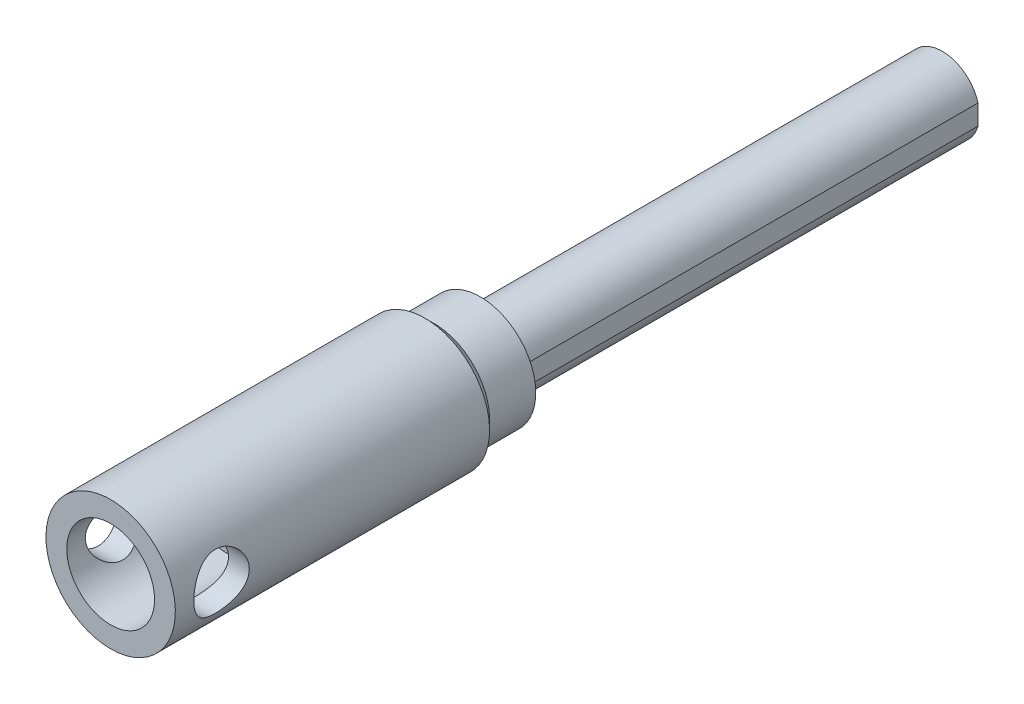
ISO-10303-21;
HEADER;
FILE_DESCRIPTION(('STEP AP214'),'2;1');
FILE_NAME('part.step','',(''),(''),'','','');
FILE_SCHEMA(('AUTOMOTIVE_DESIGN { 1 0 10303 214 1 1 1 1 }'));
ENDSEC;
DATA;
#1=APPLICATION_CONTEXT('core data for automotive mechanical design processes');
#2=APPLICATION_PROTOCOL_DEFINITION('international standard','automotive_design',2000,#1);
#3=PRODUCT_CONTEXT('',#1,'mechanical');
#4=PRODUCT('Part','Part','',(#3));
#5=PRODUCT_RELATED_PRODUCT_CATEGORY('part','',(#4));
#6=PRODUCT_DEFINITION_FORMATION('','',#4);
#7=PRODUCT_DEFINITION_CONTEXT('part definition',#1,'design');
#8=PRODUCT_DEFINITION('design','',#6,#7);
#9=PRODUCT_DEFINITION_SHAPE('','',#8);
#10=(LENGTH_UNIT() NAMED_UNIT(*) SI_UNIT(.MILLI.,.METRE.));
#11=(NAMED_UNIT(*) PLANE_ANGLE_UNIT() SI_UNIT($,.RADIAN.));
#12=(NAMED_UNIT(*) SI_UNIT($,.STERADIAN.) SOLID_ANGLE_UNIT());
#13=UNCERTAINTY_MEASURE_WITH_UNIT(LENGTH_MEASURE(1.E-05),#10,'distance_accuracy_value','');
#14=(GEOMETRIC_REPRESENTATION_CONTEXT(3) GLOBAL_UNCERTAINTY_ASSIGNED_CONTEXT((#13)) GLOBAL_UNIT_ASSIGNED_CONTEXT((#10,
#11,#12)) REPRESENTATION_CONTEXT('',''));
#15=CARTESIAN_POINT('',(0.,0.,0.));
#16=DIRECTION('',(0.,0.,1.));
#17=DIRECTION('',(1.,0.,0.));
#18=AXIS2_PLACEMENT_3D('',#15,#16,#17);
#19=CARTESIAN_POINT('',(2.3094010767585,0.,75.));
#20=DIRECTION('',(-0.866025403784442,0.5,0.));
#21=DIRECTION('',(-0.5,-0.866025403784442,0.));
#22=AXIS2_PLACEMENT_3D('',#19,#20,#21);
#23=PLANE('',#22);
#24=DIRECTION('',(0.,0.,1.));
#25=VECTOR('',#24,1.);
#26=CARTESIAN_POINT('',(1.15470053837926,-2.,75.));
#27=LINE('',#26,#25);
#28=CARTESIAN_POINT('',(1.15470053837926,-2.,75.));
#29=VERTEX_POINT('',#28);
#30=CARTESIAN_POINT('',(1.15470053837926,-2.,77.5));
#31=VERTEX_POINT('',#30);
#32=EDGE_CURVE('E273',#29,#31,#27,.T.);
#33=ORIENTED_EDGE('',*,*,#32,.T.);
#34=DIRECTION('',(-0.5,-0.866025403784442,0.));
#35=VECTOR('',#34,1.);
#36=CARTESIAN_POINT('',(2.3094010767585,0.,77.5));
#37=LINE('',#36,#35);
#38=CARTESIAN_POINT('',(2.3094010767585,0.,77.5));
#39=VERTEX_POINT('',#38);
#40=EDGE_CURVE('E29',#39,#31,#37,.T.);
#41=ORIENTED_EDGE('',*,*,#40,.F.);
#42=DIRECTION('',(0.,0.,1.));
#43=VECTOR('',#42,1.);
#44=CARTESIAN_POINT('',(2.3094010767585,0.,75.));
#45=LINE('',#44,#43);
#46=CARTESIAN_POINT('',(2.3094010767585,0.,75.));
#47=VERTEX_POINT('',#46);
#48=EDGE_CURVE('E33',#47,#39,#45,.T.);
#49=ORIENTED_EDGE('',*,*,#48,.F.);
#50=DIRECTION('',(-0.5,-0.866025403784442,0.));
#51=VECTOR('',#50,1.);
#52=CARTESIAN_POINT('',(2.3094010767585,0.,75.));
#53=LINE('',#52,#51);
#54=EDGE_CURVE('E234',#47,#29,#53,.T.);
#55=ORIENTED_EDGE('',*,*,#54,.T.);
#56=EDGE_LOOP('',(#33,#41,#49,#55));
#57=FACE_BOUND('',#56,.T.);
#58=ADVANCED_FACE('F14',(#57),#23,.T.);
#59=CARTESIAN_POINT('',(-1.15470053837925,-2.,75.));
#60=DIRECTION('',(0.,-1.,0.));
#61=DIRECTION('',(0.,0.,-1.));
#62=AXIS2_PLACEMENT_3D('',#59,#60,#61);
#63=PLANE('',#62);
#64=DIRECTION('',(0.,0.,1.));
#65=VECTOR('',#64,1.);
#66=CARTESIAN_POINT('',(-1.15470053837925,-2.,75.));
#67=LINE('',#66,#65);
#68=CARTESIAN_POINT('',(-1.15470053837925,-2.,75.));
#69=VERTEX_POINT('',#68);
#70=CARTESIAN_POINT('',(-1.15470053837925,-2.,77.5));
#71=VERTEX_POINT('',#70);
#72=EDGE_CURVE('E271',#69,#71,#67,.T.);
#73=ORIENTED_EDGE('',*,*,#72,.T.);
#74=DIRECTION('',(1.,0.,0.));
#75=VECTOR('',#74,1.);
#76=CARTESIAN_POINT('',(-1.15470053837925,-2.,77.5));
#77=LINE('',#76,#75);
#78=EDGE_CURVE('E244',#71,#31,#77,.T.);
#79=ORIENTED_EDGE('',*,*,#78,.T.);
#80=ORIENTED_EDGE('',*,*,#32,.F.);
#81=DIRECTION('',(1.,0.,0.));
#82=VECTOR('',#81,1.);
#83=CARTESIAN_POINT('',(-1.15470053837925,-2.,75.));
#84=LINE('',#83,#82);
#85=EDGE_CURVE('E260',#69,#29,#84,.T.);
#86=ORIENTED_EDGE('',*,*,#85,.F.);
#87=EDGE_LOOP('',(#73,#79,#80,#86));
#88=FACE_BOUND('',#87,.T.);
#89=ADVANCED_FACE('F164',(#88),#63,.F.);
#90=CARTESIAN_POINT('',(-2.3094010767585,0.,75.));
#91=DIRECTION('',(-0.866025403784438,-0.5,0.));
#92=DIRECTION('',(0.5,-0.866025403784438,0.));
#93=AXIS2_PLACEMENT_3D('',#90,#91,#92);
#94=PLANE('',#93);
#95=DIRECTION('',(0.,0.,1.));
#96=VECTOR('',#95,1.);
#97=CARTESIAN_POINT('',(-2.3094010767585,0.,75.));
#98=LINE('',#97,#96);
#99=CARTESIAN_POINT('',(-2.3094010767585,0.,75.));
#100=VERTEX_POINT('',#99);
#101=CARTESIAN_POINT('',(-2.3094010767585,0.,77.5));
#102=VERTEX_POINT('',#101);
#103=EDGE_CURVE('E269',#100,#102,#98,.T.);
#104=ORIENTED_EDGE('',*,*,#103,.T.);
#105=DIRECTION('',(0.5,-0.866025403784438,0.));
#106=VECTOR('',#105,1.);
#107=CARTESIAN_POINT('',(-2.3094010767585,0.,77.5));
#108=LINE('',#107,#106);
#109=EDGE_CURVE('E241',#102,#71,#108,.T.);
#110=ORIENTED_EDGE('',*,*,#109,.T.);
#111=ORIENTED_EDGE('',*,*,#72,.F.);
#112=DIRECTION('',(0.5,-0.866025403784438,0.));
#113=VECTOR('',#112,1.);
#114=CARTESIAN_POINT('',(-2.3094010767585,0.,75.));
#115=LINE('',#114,#113);
#116=EDGE_CURVE('E257',#100,#69,#115,.T.);
#117=ORIENTED_EDGE('',*,*,#116,.F.);
#118=EDGE_LOOP('',(#104,#110,#111,#117));
#119=FACE_BOUND('',#118,.T.);
#120=ADVANCED_FACE('F169',(#119),#94,.F.);
#121=CARTESIAN_POINT('',(-2.3094010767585,0.,75.));
#122=DIRECTION('',(0.866025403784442,-0.5,0.));
#123=DIRECTION('',(0.5,0.866025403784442,0.));
#124=AXIS2_PLACEMENT_3D('',#121,#122,#123);
#125=PLANE('',#124);
#126=DIRECTION('',(0.,0.,1.));
#127=VECTOR('',#126,1.);
#128=CARTESIAN_POINT('',(-1.15470053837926,2.,75.));
#129=LINE('',#128,#127);
#130=CARTESIAN_POINT('',(-1.15470053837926,2.,75.));
#131=VERTEX_POINT('',#130);
#132=CARTESIAN_POINT('',(-1.15470053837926,2.,77.5));
#133=VERTEX_POINT('',#132);
#134=EDGE_CURVE('E267',#131,#133,#129,.T.);
#135=ORIENTED_EDGE('',*,*,#134,.T.);
#136=DIRECTION('',(0.5,0.866025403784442,0.));
#137=VECTOR('',#136,1.);
#138=CARTESIAN_POINT('',(-2.3094010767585,0.,77.5));
#139=LINE('',#138,#137);
#140=EDGE_CURVE('E238',#102,#133,#139,.T.);
#141=ORIENTED_EDGE('',*,*,#140,.F.);
#142=ORIENTED_EDGE('',*,*,#103,.F.);
#143=DIRECTION('',(0.5,0.866025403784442,0.));
#144=VECTOR('',#143,1.);
#145=CARTESIAN_POINT('',(-2.3094010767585,0.,75.));
#146=LINE('',#145,#144);
#147=EDGE_CURVE('E254',#100,#131,#146,.T.);
#148=ORIENTED_EDGE('',*,*,#147,.T.);
#149=EDGE_LOOP('',(#135,#141,#142,#148));
#150=FACE_BOUND('',#149,.T.);
#151=ADVANCED_FACE('F183',(#150),#125,.T.);
#152=CARTESIAN_POINT('',(1.15470053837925,2.,75.));
#153=DIRECTION('',(0.,1.,0.));
#154=DIRECTION('',(-1.,0.,0.));
#155=AXIS2_PLACEMENT_3D('',#152,#153,#154);
#156=PLANE('',#155);
#157=DIRECTION('',(0.,0.,1.));
#158=VECTOR('',#157,1.);
#159=CARTESIAN_POINT('',(1.15470053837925,2.,75.));
#160=LINE('',#159,#158);
#161=CARTESIAN_POINT('',(1.15470053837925,2.,75.));
#162=VERTEX_POINT('',#161);
#163=CARTESIAN_POINT('',(1.15470053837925,2.,77.5));
#164=VERTEX_POINT('',#163);
#165=EDGE_CURVE('E265',#162,#164,#160,.T.);
#166=ORIENTED_EDGE('',*,*,#165,.T.);
#167=DIRECTION('',(-1.,0.,0.));
#168=VECTOR('',#167,1.);
#169=CARTESIAN_POINT('',(1.15470053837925,2.,77.5));
#170=LINE('',#169,#168);
#171=EDGE_CURVE('E235',#164,#133,#170,.T.);
#172=ORIENTED_EDGE('',*,*,#171,.T.);
#173=ORIENTED_EDGE('',*,*,#134,.F.);
#174=DIRECTION('',(-1.,0.,0.));
#175=VECTOR('',#174,1.);
#176=CARTESIAN_POINT('',(1.15470053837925,2.,75.));
#177=LINE('',#176,#175);
#178=EDGE_CURVE('E251',#162,#131,#177,.T.);
#179=ORIENTED_EDGE('',*,*,#178,.F.);
#180=EDGE_LOOP('',(#166,#172,#173,#179));
#181=FACE_BOUND('',#180,.T.);
#182=ADVANCED_FACE('F179',(#181),#156,.F.);
#183=CARTESIAN_POINT('',(2.3094010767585,0.,75.));
#184=DIRECTION('',(0.866025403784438,0.5,0.));
#185=DIRECTION('',(-0.5,0.866025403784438,0.));
#186=AXIS2_PLACEMENT_3D('',#183,#184,#185);
#187=PLANE('',#186);
#188=DIRECTION('',(-0.5,0.866025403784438,0.));
#189=VECTOR('',#188,1.);
#190=CARTESIAN_POINT('',(2.3094010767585,0.,75.));
#191=LINE('',#190,#189);
#192=EDGE_CURVE('E248',#47,#162,#191,.T.);
#193=ORIENTED_EDGE('',*,*,#192,.F.);
#194=ORIENTED_EDGE('',*,*,#48,.T.);
#195=DIRECTION('',(-0.5,0.866025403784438,0.));
#196=VECTOR('',#195,1.);
#197=CARTESIAN_POINT('',(2.3094010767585,0.,77.5));
#198=LINE('',#197,#196);
#199=EDGE_CURVE('E231',#39,#164,#198,.T.);
#200=ORIENTED_EDGE('',*,*,#199,.T.);
#201=ORIENTED_EDGE('',*,*,#165,.F.);
#202=EDGE_LOOP('',(#193,#194,#200,#201));
#203=FACE_BOUND('',#202,.T.);
#204=ADVANCED_FACE('F176',(#203),#187,.F.);
#205=CARTESIAN_POINT('',(3.46410161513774,2.,75.));
#206=DIRECTION('',(0.,0.,-1.));
#207=DIRECTION('',(0.,1.,0.));
#208=AXIS2_PLACEMENT_3D('',#205,#206,#207);
#209=PLANE('',#208);
#210=ORIENTED_EDGE('',*,*,#54,.F.);
#211=ORIENTED_EDGE('',*,*,#192,.T.);
#212=ORIENTED_EDGE('',*,*,#178,.T.);
#213=ORIENTED_EDGE('',*,*,#147,.F.);
#214=ORIENTED_EDGE('',*,*,#116,.T.);
#215=ORIENTED_EDGE('',*,*,#85,.T.);
#216=EDGE_LOOP('',(#210,#211,#212,#213,#214,#215));
#217=FACE_BOUND('',#216,.T.);
#218=ADVANCED_FACE('F174',(#217),#209,.F.);
#219=CARTESIAN_POINT('',(0.,0.,77.5));
#220=DIRECTION('',(0.,0.,1.));
#221=DIRECTION('',(0.,-1.,0.));
#222=AXIS2_PLACEMENT_3D('',#219,#220,#221);
#223=PLANE('',#222);
#224=CARTESIAN_POINT('',(0.,0.,77.5));
#225=DIRECTION('',(0.,0.,1.));
#226=DIRECTION('',(0.,-1.,0.));
#227=AXIS2_PLACEMENT_3D('',#224,#225,#226);
#228=CIRCLE('',#227,4.25);
#229=CARTESIAN_POINT('',(0.,-4.25,77.5));
#230=VERTEX_POINT('',#229);
#231=EDGE_CURVE('E9',#230,#230,#228,.T.);
#232=ORIENTED_EDGE('',*,*,#231,.T.);
#233=EDGE_LOOP('',(#232));
#234=FACE_BOUND('',#233,.T.);
#235=ORIENTED_EDGE('',*,*,#199,.F.);
#236=ORIENTED_EDGE('',*,*,#40,.T.);
#237=ORIENTED_EDGE('',*,*,#78,.F.);
#238=ORIENTED_EDGE('',*,*,#109,.F.);
#239=ORIENTED_EDGE('',*,*,#140,.T.);
#240=ORIENTED_EDGE('',*,*,#171,.F.);
#241=EDGE_LOOP('',(#235,#236,#237,#238,#239,#240));
#242=FACE_BOUND('',#241,.T.);
#243=ADVANCED_FACE('F16',(#234,#242),#223,.T.);
#244=CARTESIAN_POINT('',(0.,0.,72.5));
#245=DIRECTION('',(0.,0.,1.));
#246=DIRECTION('',(0.,-1.,0.));
#247=AXIS2_PLACEMENT_3D('',#244,#245,#246);
#248=CYLINDRICAL_SURFACE('',#247,4.25);
#249=CARTESIAN_POINT('',(0.,0.,72.5));
#250=DIRECTION('',(0.,0.,1.));
#251=DIRECTION('',(0.,-1.,0.));
#252=AXIS2_PLACEMENT_3D('',#249,#250,#251);
#253=CIRCLE('',#252,4.25);
#254=CARTESIAN_POINT('',(0.,-4.25,72.5));
#255=VERTEX_POINT('',#254);
#256=EDGE_CURVE('E22',#255,#255,#253,.T.);
#257=ORIENTED_EDGE('',*,*,#256,.T.);
#258=EDGE_LOOP('',(#257));
#259=FACE_BOUND('',#258,.T.);
#260=ORIENTED_EDGE('',*,*,#231,.F.);
#261=EDGE_LOOP('',(#260));
#262=FACE_BOUND('',#261,.T.);
#263=ADVANCED_FACE('F190',(#259,#262),#248,.T.);
#264=CARTESIAN_POINT('',(0.,0.,0.));
#265=DIRECTION('',(0.,0.,1.));
#266=DIRECTION('',(-1.,0.,0.));
#267=AXIS2_PLACEMENT_3D('',#264,#265,#266);
#268=PLANE('',#267);
#269=DIRECTION('',(0.,-1.,0.));
#270=VECTOR('',#269,1.);
#271=CARTESIAN_POINT('',(3.85,-1.08512672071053,0.));
#272=LINE('',#271,#270);
#273=CARTESIAN_POINT('',(3.85,1.08512672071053,0.));
#274=VERTEX_POINT('',#273);
#275=CARTESIAN_POINT('',(3.85,-1.08512672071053,0.));
#276=VERTEX_POINT('',#275);
#277=EDGE_CURVE('E91',#274,#276,#272,.T.);
#278=ORIENTED_EDGE('',*,*,#277,.T.);
#279=CARTESIAN_POINT('',(0.,0.,0.));
#280=DIRECTION('',(0.,0.,1.));
#281=DIRECTION('',(-1.,0.,0.));
#282=AXIS2_PLACEMENT_3D('',#279,#280,#281);
#283=CIRCLE('',#282,4.);
#284=EDGE_CURVE('E83',#274,#276,#283,.T.);
#285=ORIENTED_EDGE('',*,*,#284,.F.);
#286=EDGE_LOOP('',(#278,#285));
#287=FACE_BOUND('',#286,.T.);
#288=ADVANCED_FACE('F95',(#287),#268,.F.);
#289=CARTESIAN_POINT('',(3.85,-1.08512672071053,60.));
#290=DIRECTION('',(1.,0.,0.));
#291=DIRECTION('',(0.,0.,1.));
#292=AXIS2_PLACEMENT_3D('',#289,#290,#291);
#293=PLANE('',#292);
#294=DIRECTION('',(0.,1.,0.));
#295=VECTOR('',#294,1.);
#296=CARTESIAN_POINT('',(3.85,5.9999999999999,50.));
#297=LINE('',#296,#295);
#298=CARTESIAN_POINT('',(3.85,-1.08512672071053,50.));
#299=VERTEX_POINT('',#298);
#300=CARTESIAN_POINT('',(3.85,1.08512672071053,50.));
#301=VERTEX_POINT('',#300);
#302=EDGE_CURVE('E226',#299,#301,#297,.T.);
#303=ORIENTED_EDGE('',*,*,#302,.F.);
#304=DIRECTION('',(0.,0.,-1.));
#305=VECTOR('',#304,1.);
#306=CARTESIAN_POINT('',(3.85,-1.08512672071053,60.));
#307=LINE('',#306,#305);
#308=EDGE_CURVE('E88',#299,#276,#307,.T.);
#309=ORIENTED_EDGE('',*,*,#308,.T.);
#310=ORIENTED_EDGE('',*,*,#277,.F.);
#311=DIRECTION('',(0.,0.,-1.));
#312=VECTOR('',#311,1.);
#313=CARTESIAN_POINT('',(3.85,1.08512672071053,60.));
#314=LINE('',#313,#312);
#315=EDGE_CURVE('E78',#301,#274,#314,.T.);
#316=ORIENTED_EDGE('',*,*,#315,.F.);
#317=EDGE_LOOP('',(#303,#309,#310,#316));
#318=FACE_BOUND('',#317,.T.);
#319=ADVANCED_FACE('F92',(#318),#293,.T.);
#320=CARTESIAN_POINT('',(0.,0.,60.));
#321=DIRECTION('',(0.,0.,-1.));
#322=DIRECTION('',(1.,0.,0.));
#323=AXIS2_PLACEMENT_3D('',#320,#321,#322);
#324=CYLINDRICAL_SURFACE('',#323,4.);
#325=ORIENTED_EDGE('',*,*,#308,.F.);
#326=CARTESIAN_POINT('',(0.,0.,50.));
#327=DIRECTION('',(0.,0.,1.));
#328=DIRECTION('',(-6.15310496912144E-10,1.,0.));
#329=AXIS2_PLACEMENT_3D('',#326,#327,#328);
#330=CIRCLE('',#329,4.);
#331=EDGE_CURVE('E84',#299,#301,#330,.F.);
#332=ORIENTED_EDGE('',*,*,#331,.T.);
#333=ORIENTED_EDGE('',*,*,#315,.T.);
#334=ORIENTED_EDGE('',*,*,#284,.T.);
#335=EDGE_LOOP('',(#325,#332,#333,#334));
#336=FACE_BOUND('',#335,.T.);
#337=ADVANCED_FACE('F81',(#336),#324,.T.);
#338=CARTESIAN_POINT('',(0.,5.99999999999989,50.));
#339=DIRECTION('',(0.,0.,1.));
#340=DIRECTION('',(0.,-1.,0.));
#341=AXIS2_PLACEMENT_3D('',#338,#339,#340);
#342=PLANE('',#341);
#343=CARTESIAN_POINT('',(0.,0.,50.));
#344=DIRECTION('',(0.,0.,1.));
#345=DIRECTION('',(0.,-1.,0.));
#346=AXIS2_PLACEMENT_3D('',#343,#344,#345);
#347=CIRCLE('',#346,5.99999999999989);
#348=CARTESIAN_POINT('',(0.,-5.99999999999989,50.));
#349=VERTEX_POINT('',#348);
#350=EDGE_CURVE('E221',#349,#349,#347,.T.);
#351=ORIENTED_EDGE('',*,*,#350,.F.);
#352=EDGE_LOOP('',(#351));
#353=FACE_BOUND('',#352,.T.);
#354=ORIENTED_EDGE('',*,*,#331,.F.);
#355=ORIENTED_EDGE('',*,*,#302,.T.);
#356=EDGE_LOOP('',(#354,#355));
#357=FACE_BOUND('',#356,.T.);
#358=ADVANCED_FACE('F327',(#353,#357),#342,.F.);
#359=CARTESIAN_POINT('',(0.,0.,92.7596866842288));
#360=DIRECTION('',(0.,0.,1.));
#361=DIRECTION('',(0.,-1.,0.));
#362=AXIS2_PLACEMENT_3D('',#359,#360,#361);
#363=CYLINDRICAL_SURFACE('',#362,5.99999999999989);
#364=CARTESIAN_POINT('',(0.,0.,55.));
#365=DIRECTION('',(0.,0.,1.));
#366=DIRECTION('',(0.,-1.,0.));
#367=AXIS2_PLACEMENT_3D('',#364,#365,#366);
#368=CIRCLE('',#367,5.99999999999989);
#369=CARTESIAN_POINT('',(0.,-5.99999999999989,55.));
#370=VERTEX_POINT('',#369);
#371=EDGE_CURVE('E219',#370,#370,#368,.T.);
#372=ORIENTED_EDGE('',*,*,#371,.F.);
#373=EDGE_LOOP('',(#372));
#374=FACE_BOUND('',#373,.T.);
#375=ORIENTED_EDGE('',*,*,#350,.T.);
#376=EDGE_LOOP('',(#375));
#377=FACE_BOUND('',#376,.T.);
#378=ADVANCED_FACE('F335',(#374,#377),#363,.T.);
#379=CARTESIAN_POINT('',(0.,0.,56.));
#380=DIRECTION('',(0.,0.,1.));
#381=DIRECTION('',(0.,-1.,0.));
#382=AXIS2_PLACEMENT_3D('',#379,#380,#381);
#383=CONICAL_SURFACE('',#382,7.0000000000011,0.78539816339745);
#384=ORIENTED_EDGE('',*,*,#371,.T.);
#385=EDGE_LOOP('',(#384));
#386=FACE_BOUND('',#385,.T.);
#387=CARTESIAN_POINT('',(0.,0.,56.));
#388=DIRECTION('',(0.,0.,1.));
#389=DIRECTION('',(0.,-1.,0.));
#390=AXIS2_PLACEMENT_3D('',#387,#388,#389);
#391=CIRCLE('',#390,7.0000000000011);
#392=CARTESIAN_POINT('',(0.,-7.0000000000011,56.));
#393=VERTEX_POINT('',#392);
#394=EDGE_CURVE('E145',#393,#393,#391,.T.);
#395=ORIENTED_EDGE('',*,*,#394,.F.);
#396=EDGE_LOOP('',(#395));
#397=FACE_BOUND('',#396,.T.);
#398=ADVANCED_FACE('F128',(#386,#397),#383,.T.);
#399=CARTESIAN_POINT('',(0.,0.,92.7596866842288));
#400=DIRECTION('',(0.,0.,1.));
#401=DIRECTION('',(0.,-1.,0.));
#402=AXIS2_PLACEMENT_3D('',#399,#400,#401);
#403=CYLINDRICAL_SURFACE('',#402,7.0000000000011);
#404=ORIENTED_EDGE('',*,*,#394,.T.);
#405=EDGE_LOOP('',(#404));
#406=FACE_BOUND('',#405,.T.);
#407=CARTESIAN_POINT('',(-7.0000000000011,1.09818090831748E-12,88.));
#408=CARTESIAN_POINT('',(-6.99999408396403,-0.160281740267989,87.9999925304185));
#409=CARTESIAN_POINT('',(-6.9944325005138,-0.320833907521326,87.9870786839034));
#410=CARTESIAN_POINT('',(-6.97273920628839,-0.637349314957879,87.9359176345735));
#411=CARTESIAN_POINT('',(-6.95658080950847,-0.793299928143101,87.8976064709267));
#412=CARTESIAN_POINT('',(-6.91541630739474,-1.09553470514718,87.7973302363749));
#413=CARTESIAN_POINT('',(-6.89044089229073,-1.24185033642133,87.7354471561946));
#414=CARTESIAN_POINT('',(-6.83405660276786,-1.52187332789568,87.5901355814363));
#415=CARTESIAN_POINT('',(-6.80264947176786,-1.65558409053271,87.5067129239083));
#416=CARTESIAN_POINT('',(-6.73467821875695,-1.91384144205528,87.3160723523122));
#417=CARTESIAN_POINT('',(-6.6979389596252,-2.03764045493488,87.2079047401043));
#418=CARTESIAN_POINT('',(-6.62417654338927,-2.26599040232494,86.9728561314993));
#419=CARTESIAN_POINT('',(-6.58715324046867,-2.37053065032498,86.8459648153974));
#420=CARTESIAN_POINT('',(-6.51482055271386,-2.56285686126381,86.5689672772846));
#421=CARTESIAN_POINT('',(-6.4797046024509,-2.64946811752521,86.4179895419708));
#422=CARTESIAN_POINT('',(-6.41796168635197,-2.79573199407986,86.1018905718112));
#423=CARTESIAN_POINT('',(-6.39133010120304,-2.85539929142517,85.9367770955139));
#424=CARTESIAN_POINT('',(-6.35147799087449,-2.94294919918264,85.6056992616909));
#425=CARTESIAN_POINT('',(-6.33765221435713,-2.97227494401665,85.4401922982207));
#426=CARTESIAN_POINT('',(-6.32324849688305,-3.00280607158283,85.1060740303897));
#427=CARTESIAN_POINT('',(-6.32266262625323,-3.00402828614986,84.9374646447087));
#428=CARTESIAN_POINT('',(-6.33429573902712,-2.97939999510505,84.6167000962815));
#429=CARTESIAN_POINT('',(-6.34546870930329,-2.95576113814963,84.464329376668));
#430=CARTESIAN_POINT('',(-6.37758411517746,-2.88580772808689,84.1659724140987));
#431=CARTESIAN_POINT('',(-6.39852855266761,-2.83948852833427,84.0199874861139));
#432=CARTESIAN_POINT('',(-6.44830685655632,-2.72457659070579,83.7347528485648));
#433=CARTESIAN_POINT('',(-6.47730295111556,-2.65551974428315,83.5957197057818));
#434=CARTESIAN_POINT('',(-6.5398849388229,-2.497423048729,83.3306536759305));
#435=CARTESIAN_POINT('',(-6.57347269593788,-2.40837507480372,83.2046261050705));
#436=CARTESIAN_POINT('',(-6.64512404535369,-2.20343405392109,82.9572224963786));
#437=CARTESIAN_POINT('',(-6.68331855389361,-2.08584728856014,82.837283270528));
#438=CARTESIAN_POINT('',(-6.75734605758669,-1.83187332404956,82.618328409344));
#439=CARTESIAN_POINT('',(-6.79317843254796,-1.69548121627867,82.5193182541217));
#440=CARTESIAN_POINT('',(-6.85959693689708,-1.40318582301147,82.342756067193));
#441=CARTESIAN_POINT('',(-6.89002455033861,-1.24687114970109,82.2658209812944));
#442=CARTESIAN_POINT('',(-6.94097396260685,-0.921879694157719,82.1398497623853));
#443=CARTESIAN_POINT('',(-6.96150156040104,-0.753210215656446,82.0907972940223));
#444=CARTESIAN_POINT('',(-6.98923526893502,-0.420276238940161,82.0250661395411));
#445=CARTESIAN_POINT('',(-6.99723249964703,-0.256457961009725,82.0064612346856));
#446=CARTESIAN_POINT('',(-7.00155416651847,0.0721433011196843,81.9963704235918));
#447=CARTESIAN_POINT('',(-6.99788220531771,0.236925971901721,82.0048761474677));
#448=CARTESIAN_POINT('',(-6.97978676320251,0.553542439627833,82.0474156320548));
#449=CARTESIAN_POINT('',(-6.96594519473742,0.705598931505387,82.0800683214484));
#450=CARTESIAN_POINT('',(-6.92953888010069,1.00189113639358,82.1680208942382));
#451=CARTESIAN_POINT('',(-6.90697304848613,1.14612587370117,82.2233235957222));
#452=CARTESIAN_POINT('',(-6.85438751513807,1.42777696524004,82.3568011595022));
#453=CARTESIAN_POINT('',(-6.8241570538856,1.56483974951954,82.4356363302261));
#454=CARTESIAN_POINT('',(-6.7594298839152,1.82428490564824,82.613218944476));
#455=CARTESIAN_POINT('',(-6.72493135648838,1.9466609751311,82.7119748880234));
#456=CARTESIAN_POINT('',(-6.6521478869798,2.18296759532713,82.935289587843));
#457=CARTESIAN_POINT('',(-6.61377354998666,2.29556617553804,83.0612322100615));
#458=CARTESIAN_POINT('',(-6.53984037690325,2.49843431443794,83.3307822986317));
#459=CARTESIAN_POINT('',(-6.50428232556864,2.58869766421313,83.474394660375));
#460=CARTESIAN_POINT('',(-6.43962969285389,2.74563875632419,83.7788138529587));
#461=CARTESIAN_POINT('',(-6.41066255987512,2.81186415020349,83.9398830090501));
#462=CARTESIAN_POINT('',(-6.36413607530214,2.91565885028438,84.2725263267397));
#463=CARTESIAN_POINT('',(-6.34656658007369,2.95325364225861,84.4440909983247));
#464=CARTESIAN_POINT('',(-6.3264348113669,2.99611948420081,84.7779911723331));
#465=CARTESIAN_POINT('',(-6.3227792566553,3.00374693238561,84.9399592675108));
#466=CARTESIAN_POINT('',(-6.32795618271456,2.99282649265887,85.2627897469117));
#467=CARTESIAN_POINT('',(-6.33678646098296,2.97428322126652,85.4236523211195));
#468=CARTESIAN_POINT('',(-6.36491653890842,2.91356431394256,85.7310416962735));
#469=CARTESIAN_POINT('',(-6.3836471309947,2.87266975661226,85.8778787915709));
#470=CARTESIAN_POINT('',(-6.42898875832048,2.76970222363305,86.162620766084));
#471=CARTESIAN_POINT('',(-6.4556020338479,2.70762322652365,86.3005230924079));
#472=CARTESIAN_POINT('',(-6.51575247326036,2.55963250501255,86.5728207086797));
#473=CARTESIAN_POINT('',(-6.54961649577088,2.47248232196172,86.7064691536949));
#474=CARTESIAN_POINT('',(-6.61959778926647,2.27849600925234,86.9579823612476));
#475=CARTESIAN_POINT('',(-6.6557159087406,2.17165243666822,87.0758411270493));
#476=CARTESIAN_POINT('',(-6.72955424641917,1.93135048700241,87.3020036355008));
#477=CARTESIAN_POINT('',(-6.76717599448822,1.79645724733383,87.4088195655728));
#478=CARTESIAN_POINT('',(-6.83696477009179,1.50919760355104,87.5984397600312));
#479=CARTESIAN_POINT('',(-6.86912932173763,1.35682332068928,87.6812331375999));
#480=CARTESIAN_POINT('',(-6.91035442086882,1.11954532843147,87.7845926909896));
#481=CARTESIAN_POINT('',(-6.92286397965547,1.03957288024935,87.8154332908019));
#482=CARTESIAN_POINT('',(-6.94533202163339,0.876970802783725,87.8702382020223));
#483=CARTESIAN_POINT('',(-6.9552917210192,0.794342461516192,87.8942057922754));
#484=CARTESIAN_POINT('',(-6.97234378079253,0.627265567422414,87.9349477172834));
#485=CARTESIAN_POINT('',(-6.97944312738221,0.542821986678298,87.9517395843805));
#486=CARTESIAN_POINT('',(-6.99059319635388,0.372647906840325,87.9780087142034));
#487=CARTESIAN_POINT('',(-6.99464610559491,0.286918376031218,87.987491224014));
#488=CARTESIAN_POINT('',(-6.99807592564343,0.167492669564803,87.9955082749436));
#489=CARTESIAN_POINT('',(-6.9987967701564,0.134021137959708,87.9971918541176));
#490=CARTESIAN_POINT('',(-6.9997594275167,0.0670370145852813,87.9994385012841));
#491=CARTESIAN_POINT('',(-7.00000123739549,0.0335244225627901,88.0000015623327));
#492=CARTESIAN_POINT('',(-7.0000000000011,1.09818090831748E-12,88.));
#493=B_SPLINE_CURVE_WITH_KNOTS('',3,(#407,#408,#409,#410,#411,#412,#413,#414,#415,#416,#417,
#418,#419,#420,#421,#422,#423,#424,#425,#426,#427,#428,#429,#430,#431,#432,#433,#434,#435,#436,
#437,#438,#439,#440,#441,#442,#443,#444,#445,#446,#447,#448,#449,#450,#451,#452,#453,#454,#455,
#456,#457,#458,#459,#460,#461,#462,#463,#464,#465,#466,#467,#468,#469,#470,#471,#472,#473,#474,
#475,#476,#477,#478,#479,#480,#481,#482,#483,#484,#485,#486,#487,#488,#489,#490,#491,#492),
.UNSPECIFIED.,.T.,.F.,(4,2,2,2,2,2,2,2,2,2,2,2,2,2,2,2,2,2,2,2,2,2,2,2,2,2,2,2,2,2,2,2,2,2,2,2,
2,2,2,2,2,2,4),(0.,0.48071432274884,0.962643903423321,1.44291226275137,1.92305060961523,
2.42622743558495,2.9296826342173,3.45969560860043,3.98941952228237,4.4925942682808,
4.99546764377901,5.45710720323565,5.91884138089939,6.39065408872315,6.86265889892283,
7.3770983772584,7.89167239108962,8.41947244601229,8.94696296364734,9.43957347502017,
9.93203191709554,10.3983119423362,10.8646499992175,11.345550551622,11.8266567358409,
12.3440285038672,12.8615439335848,13.3883469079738,13.9146803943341,14.3986848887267,
14.8826040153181,15.341320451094,15.8001673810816,16.2874475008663,16.7749121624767,
17.3008416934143,17.8270092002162,18.0865840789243,18.3460349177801,18.6048481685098,
18.8634754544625,18.9640207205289,19.0645666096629),.UNSPECIFIED.);
#494=CARTESIAN_POINT('',(-7.0000000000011,1.09818090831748E-12,88.));
#495=VERTEX_POINT('',#494);
#496=EDGE_CURVE('E111',#495,#495,#493,.T.);
#497=ORIENTED_EDGE('',*,*,#496,.T.);
#498=EDGE_LOOP('',(#497));
#499=FACE_BOUND('',#498,.T.);
#500=CARTESIAN_POINT('',(7.0000000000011,1.1500207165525E-12,88.));
#501=CARTESIAN_POINT('',(6.99999408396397,0.16028174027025,87.9999925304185));
#502=CARTESIAN_POINT('',(6.9944325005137,0.320833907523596,87.9870786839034));
#503=CARTESIAN_POINT('',(6.97273920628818,0.637349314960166,87.9359176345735));
#504=CARTESIAN_POINT('',(6.95658080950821,0.793299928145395,87.8976064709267));
#505=CARTESIAN_POINT('',(6.91541630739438,1.09553470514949,87.7973302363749));
#506=CARTESIAN_POINT('',(6.89044089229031,1.24185033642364,87.7354471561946));
#507=CARTESIAN_POINT('',(6.83405660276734,1.52187332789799,87.5901355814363));
#508=CARTESIAN_POINT('',(6.80264947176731,1.65558409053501,87.5067129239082));
#509=CARTESIAN_POINT('',(6.7346782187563,1.91384144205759,87.3160723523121));
#510=CARTESIAN_POINT('',(6.6979389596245,2.03764045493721,87.2079047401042));
#511=CARTESIAN_POINT('',(6.62417654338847,2.26599040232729,86.9728561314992));
#512=CARTESIAN_POINT('',(6.58715324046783,2.37053065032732,86.8459648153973));
#513=CARTESIAN_POINT('',(6.51482055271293,2.56285686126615,86.5689672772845));
#514=CARTESIAN_POINT('',(6.47970460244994,2.64946811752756,86.4179895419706));
#515=CARTESIAN_POINT('',(6.41796168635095,2.79573199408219,86.1018905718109));
#516=CARTESIAN_POINT('',(6.39133010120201,2.85539929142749,85.9367770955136));
#517=CARTESIAN_POINT('',(6.35147799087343,2.94294919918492,85.6056992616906));
#518=CARTESIAN_POINT('',(6.33765221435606,2.97227494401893,85.4401922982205));
#519=CARTESIAN_POINT('',(6.32324849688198,3.00280607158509,85.1060740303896));
#520=CARTESIAN_POINT('',(6.32266262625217,3.00402828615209,84.9374646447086));
#521=CARTESIAN_POINT('',(6.33429573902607,2.97939999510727,84.6167000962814));
#522=CARTESIAN_POINT('',(6.34546870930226,2.95576113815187,84.464329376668));
#523=CARTESIAN_POINT('',(6.37758411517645,2.88580772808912,84.1659724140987));
#524=CARTESIAN_POINT('',(6.39852855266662,2.8394885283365,84.0199874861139));
#525=CARTESIAN_POINT('',(6.44830685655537,2.72457659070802,83.7347528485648));
#526=CARTESIAN_POINT('',(6.47730295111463,2.6555197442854,83.5957197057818));
#527=CARTESIAN_POINT('',(6.53988493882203,2.49742304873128,83.3306536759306));
#528=CARTESIAN_POINT('',(6.57347269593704,2.40837507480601,83.2046261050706));
#529=CARTESIAN_POINT('',(6.64512404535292,2.2034340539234,82.9572224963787));
#530=CARTESIAN_POINT('',(6.68331855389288,2.08584728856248,82.837283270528));
#531=CARTESIAN_POINT('',(6.75734605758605,1.83187332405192,82.6183284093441));
#532=CARTESIAN_POINT('',(6.79317843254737,1.69548121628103,82.5193182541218));
#533=CARTESIAN_POINT('',(6.85959693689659,1.40318582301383,82.3427560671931));
#534=CARTESIAN_POINT('',(6.89002455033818,1.24687114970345,82.2658209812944));
#535=CARTESIAN_POINT('',(6.94097396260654,0.92187969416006,82.1398497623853));
#536=CARTESIAN_POINT('',(6.96150156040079,0.753210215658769,82.0907972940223));
#537=CARTESIAN_POINT('',(6.98923526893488,0.420276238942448,82.0250661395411));
#538=CARTESIAN_POINT('',(6.99723249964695,0.256457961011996,82.0064612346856));
#539=CARTESIAN_POINT('',(7.00155416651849,-0.0721433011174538,81.9963704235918));
#540=CARTESIAN_POINT('',(6.99788220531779,-0.236925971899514,82.0048761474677));
#541=CARTESIAN_POINT('',(6.97978676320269,-0.553542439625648,82.0474156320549));
#542=CARTESIAN_POINT('',(6.96594519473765,-0.705598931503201,82.0800683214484));
#543=CARTESIAN_POINT('',(6.929538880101,-1.00189113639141,82.1680208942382));
#544=CARTESIAN_POINT('',(6.90697304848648,-1.14612587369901,82.2233235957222));
#545=CARTESIAN_POINT('',(6.85438751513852,-1.42777696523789,82.3568011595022));
#546=CARTESIAN_POINT('',(6.82415705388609,-1.56483974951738,82.4356363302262));
#547=CARTESIAN_POINT('',(6.75942988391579,-1.82428490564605,82.6132189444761));
#548=CARTESIAN_POINT('',(6.72493135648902,-1.9466609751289,82.7119748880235));
#549=CARTESIAN_POINT('',(6.65214788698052,-2.18296759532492,82.9352895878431));
#550=CARTESIAN_POINT('',(6.61377354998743,-2.29556617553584,83.0612322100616));
#551=CARTESIAN_POINT('',(6.5398403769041,-2.49843431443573,83.3307822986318));
#552=CARTESIAN_POINT('',(6.50428232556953,-2.58869766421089,83.474394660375));
#553=CARTESIAN_POINT('',(6.43962969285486,-2.74563875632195,83.7788138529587));
#554=CARTESIAN_POINT('',(6.41066255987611,-2.81186415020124,83.9398830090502));
#555=CARTESIAN_POINT('',(6.36413607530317,-2.91565885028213,84.2725263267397));
#556=CARTESIAN_POINT('',(6.34656658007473,-2.95325364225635,84.4440909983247));
#557=CARTESIAN_POINT('',(6.32643481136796,-2.99611948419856,84.7779911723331));
#558=CARTESIAN_POINT('',(6.32277925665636,-3.00374693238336,84.9399592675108));
#559=CARTESIAN_POINT('',(6.32795618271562,-2.99282649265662,85.2627897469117));
#560=CARTESIAN_POINT('',(6.33678646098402,-2.97428322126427,85.4236523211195));
#561=CARTESIAN_POINT('',(6.36491653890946,-2.9135643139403,85.7310416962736));
#562=CARTESIAN_POINT('',(6.38364713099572,-2.87266975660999,85.877878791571));
#563=CARTESIAN_POINT('',(6.42898875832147,-2.76970222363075,86.1626207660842));
#564=CARTESIAN_POINT('',(6.45560203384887,-2.70762322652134,86.300523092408));
#565=CARTESIAN_POINT('',(6.51575247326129,-2.5596325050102,86.5728207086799));
#566=CARTESIAN_POINT('',(6.54961649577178,-2.47248232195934,86.7064691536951));
#567=CARTESIAN_POINT('',(6.61959778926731,-2.2784960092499,86.9579823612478));
#568=CARTESIAN_POINT('',(6.6557159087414,-2.17165243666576,87.0758411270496));
#569=CARTESIAN_POINT('',(6.72955424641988,-1.93135048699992,87.302003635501));
#570=CARTESIAN_POINT('',(6.76717599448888,-1.79645724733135,87.408819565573));
#571=CARTESIAN_POINT('',(6.83696477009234,-1.50919760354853,87.5984397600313));
#572=CARTESIAN_POINT('',(6.86912932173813,-1.35682332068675,87.6812331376));
#573=CARTESIAN_POINT('',(6.91035442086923,-1.11954532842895,87.7845926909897));
#574=CARTESIAN_POINT('',(6.92286397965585,-1.03957288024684,87.815433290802));
#575=CARTESIAN_POINT('',(6.9453320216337,-0.876970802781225,87.8702382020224));
#576=CARTESIAN_POINT('',(6.95529172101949,-0.794342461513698,87.8942057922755));
#577=CARTESIAN_POINT('',(6.97234378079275,-0.627265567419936,87.9349477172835));
#578=CARTESIAN_POINT('',(6.97944312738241,-0.542821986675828,87.9517395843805));
#579=CARTESIAN_POINT('',(6.99059319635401,-0.372647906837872,87.9780087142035));
#580=CARTESIAN_POINT('',(6.99464610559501,-0.286918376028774,87.987491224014));
#581=CARTESIAN_POINT('',(6.99807592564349,-0.167492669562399,87.9955082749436));
#582=CARTESIAN_POINT('',(6.99879677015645,-0.134021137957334,87.9971918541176));
#583=CARTESIAN_POINT('',(6.99975942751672,-0.0670370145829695,87.9994385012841));
#584=CARTESIAN_POINT('',(7.0000012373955,-0.03352442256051,88.0000015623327));
#585=CARTESIAN_POINT('',(7.0000000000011,1.1500207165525E-12,88.));
#586=B_SPLINE_CURVE_WITH_KNOTS('',3,(#500,#501,#502,#503,#504,#505,#506,#507,#508,#509,#510,
#511,#512,#513,#514,#515,#516,#517,#518,#519,#520,#521,#522,#523,#524,#525,#526,#527,#528,#529,
#530,#531,#532,#533,#534,#535,#536,#537,#538,#539,#540,#541,#542,#543,#544,#545,#546,#547,#548,
#549,#550,#551,#552,#553,#554,#555,#556,#557,#558,#559,#560,#561,#562,#563,#564,#565,#566,#567,
#568,#569,#570,#571,#572,#573,#574,#575,#576,#577,#578,#579,#580,#581,#582,#583,#584,#585),
.UNSPECIFIED.,.T.,.F.,(4,2,2,2,2,2,2,2,2,2,2,2,2,2,2,2,2,2,2,2,2,2,2,2,2,2,2,2,2,2,2,2,2,2,2,2,
2,2,2,2,2,2,4),(0.,0.480714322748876,0.962643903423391,1.44291226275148,1.92305060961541,
2.42622743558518,2.92968263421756,3.45969560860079,3.98941952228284,4.49259426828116,
4.99546764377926,5.45710720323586,5.91884138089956,6.39065408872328,6.86265889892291,
7.37709837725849,7.89167239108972,8.41947244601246,8.94696296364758,9.43957347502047,
9.93203191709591,10.3983119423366,10.8646499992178,11.3455505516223,11.8266567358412,
12.3440285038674,12.861543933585,13.388346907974,13.9146803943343,14.3986848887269,
14.8826040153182,15.3413204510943,15.800167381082,16.2874475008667,16.7749121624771,
17.3008416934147,17.8270092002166,18.0865840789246,18.3460349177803,18.60484816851,
18.8634754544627,18.964020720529,19.0645666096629),.UNSPECIFIED.);
#587=CARTESIAN_POINT('',(7.0000000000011,1.1500207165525E-12,88.));
#588=VERTEX_POINT('',#587);
#589=EDGE_CURVE('E103',#588,#588,#586,.T.);
#590=ORIENTED_EDGE('',*,*,#589,.T.);
#591=EDGE_LOOP('',(#590));
#592=FACE_BOUND('',#591,.T.);
#593=CARTESIAN_POINT('',(0.,0.,90.));
#594=DIRECTION('',(0.,0.,1.));
#595=DIRECTION('',(0.,-1.,0.));
#596=AXIS2_PLACEMENT_3D('',#593,#594,#595);
#597=CIRCLE('',#596,7.00000000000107);
#598=CARTESIAN_POINT('',(0.,-7.00000000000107,90.));
#599=VERTEX_POINT('',#598);
#600=EDGE_CURVE('E213',#599,#599,#597,.T.);
#601=ORIENTED_EDGE('',*,*,#600,.F.);
#602=EDGE_LOOP('',(#601));
#603=FACE_BOUND('',#602,.T.);
#604=ADVANCED_FACE('F116',(#406,#499,#592,#603),#403,.T.);
#605=CARTESIAN_POINT('',(0.,7.00000000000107,90.));
#606=DIRECTION('',(0.,0.,-1.));
#607=DIRECTION('',(0.,1.,0.));
#608=AXIS2_PLACEMENT_3D('',#605,#606,#607);
#609=PLANE('',#608);
#610=CARTESIAN_POINT('',(0.,0.,90.));
#611=DIRECTION('',(0.,0.,1.));
#612=DIRECTION('',(0.,-1.,0.));
#613=AXIS2_PLACEMENT_3D('',#610,#611,#612);
#614=CIRCLE('',#613,4.75);
#615=CARTESIAN_POINT('',(0.,-4.75,90.));
#616=VERTEX_POINT('',#615);
#617=EDGE_CURVE('E211',#616,#616,#614,.T.);
#618=ORIENTED_EDGE('',*,*,#617,.F.);
#619=EDGE_LOOP('',(#618));
#620=FACE_BOUND('',#619,.T.);
#621=ORIENTED_EDGE('',*,*,#600,.T.);
#622=EDGE_LOOP('',(#621));
#623=FACE_BOUND('',#622,.T.);
#624=ADVANCED_FACE('F150',(#620,#623),#609,.F.);
#625=CARTESIAN_POINT('',(-15.,1.06855816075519E-12,85.));
#626=DIRECTION('',(1.,0.,0.));
#627=DIRECTION('',(0.,0.,1.));
#628=AXIS2_PLACEMENT_3D('',#625,#626,#627);
#629=CYLINDRICAL_SURFACE('',#628,3.);
#630=CARTESIAN_POINT('',(4.75,1.14168931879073E-12,88.));
#631=CARTESIAN_POINT('',(4.74999955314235,-0.0761103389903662,87.9999994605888));
#632=CARTESIAN_POINT('',(4.74816499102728,-0.15222297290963,87.9970977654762));
#633=CARTESIAN_POINT('',(4.74088144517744,-0.30384472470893,87.9855439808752));
#634=CARTESIAN_POINT('',(4.73543103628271,-0.379353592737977,87.976889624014));
#635=CARTESIAN_POINT('',(4.71380589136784,-0.604265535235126,87.9424168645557));
#636=CARTESIAN_POINT('',(4.69235743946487,-0.751968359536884,87.9080889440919));
#637=CARTESIAN_POINT('',(4.63755605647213,-1.03764440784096,87.8188025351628));
#638=CARTESIAN_POINT('',(4.60426199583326,-1.17566177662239,87.76394600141));
#639=CARTESIAN_POINT('',(4.52853238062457,-1.44007270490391,87.6358626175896));
#640=CARTESIAN_POINT('',(4.48609752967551,-1.56646715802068,87.5626371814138));
#641=CARTESIAN_POINT('',(4.39152281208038,-1.81553885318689,87.3933868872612));
#642=CARTESIAN_POINT('',(4.33887608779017,-1.93709280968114,87.2959989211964));
#643=CARTESIAN_POINT('',(4.23068324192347,-2.16323071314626,87.0843374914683));
#644=CARTESIAN_POINT('',(4.17513324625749,-2.26779117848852,86.9700410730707));
#645=CARTESIAN_POINT('',(4.0581440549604,-2.47176260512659,86.709238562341));
#646=CARTESIAN_POINT('',(3.99695850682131,-2.5684412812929,86.5604636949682));
#647=CARTESIAN_POINT('',(3.8847799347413,-2.73516117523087,86.2452093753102));
#648=CARTESIAN_POINT('',(3.83376964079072,-2.80524771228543,86.07876066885));
#649=CARTESIAN_POINT('',(3.76186029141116,-2.90060198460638,85.7774692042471));
#650=CARTESIAN_POINT('',(3.73656719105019,-2.93281686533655,85.6458813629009));
#651=CARTESIAN_POINT('',(3.69968522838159,-2.97921746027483,85.3777642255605));
#652=CARTESIAN_POINT('',(3.68807636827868,-2.99342948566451,85.2412424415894));
#653=CARTESIAN_POINT('',(3.68031818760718,-3.00296624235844,84.9666960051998));
#654=CARTESIAN_POINT('',(3.68421247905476,-2.99823769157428,84.8286682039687));
#655=CARTESIAN_POINT('',(3.70692728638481,-2.97009984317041,84.5557449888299));
#656=CARTESIAN_POINT('',(3.72575992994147,-2.9466753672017,84.4208522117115));
#657=CARTESIAN_POINT('',(3.77495885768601,-2.88335211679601,84.1611244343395));
#658=CARTESIAN_POINT('',(3.8050150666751,-2.84389393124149,84.036119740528));
#659=CARTESIAN_POINT('',(3.87334508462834,-2.75010154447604,83.7942686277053));
#660=CARTESIAN_POINT('',(3.91162177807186,-2.69576211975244,83.6774250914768));
#661=CARTESIAN_POINT('',(4.00084802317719,-2.56189972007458,83.4316269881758));
#662=CARTESIAN_POINT('',(4.05282406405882,-2.4795545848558,83.3045818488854));
#663=CARTESIAN_POINT('',(4.1588740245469,-2.2972659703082,83.0647177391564));
#664=CARTESIAN_POINT('',(4.21295008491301,-2.19730414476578,82.9519138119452));
#665=CARTESIAN_POINT('',(4.32806963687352,-1.96218966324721,82.723821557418));
#666=CARTESIAN_POINT('',(4.38870849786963,-1.82394123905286,82.6114532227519));
#667=CARTESIAN_POINT('',(4.4725891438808,-1.60149131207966,82.4616457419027));
#668=CARTESIAN_POINT('',(4.49938196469,-1.52478418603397,82.4148144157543));
#669=CARTESIAN_POINT('',(4.54988768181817,-1.36670658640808,82.3278781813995));
#670=CARTESIAN_POINT('',(4.57360246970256,-1.28533902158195,82.287769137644));
#671=CARTESIAN_POINT('',(4.61615250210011,-1.12265227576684,82.2166327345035));
#672=CARTESIAN_POINT('',(4.63517339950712,-1.04153722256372,82.185249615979));
#673=CARTESIAN_POINT('',(4.66925448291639,-0.87617542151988,82.129473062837));
#674=CARTESIAN_POINT('',(4.68431697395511,-0.791930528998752,82.1050755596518));
#675=CARTESIAN_POINT('',(4.71001494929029,-0.621054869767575,82.0636748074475));
#676=CARTESIAN_POINT('',(4.72065460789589,-0.534426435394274,82.0466645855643));
#677=CARTESIAN_POINT('',(4.73718438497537,-0.359599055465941,82.0203160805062));
#678=CARTESIAN_POINT('',(4.74307535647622,-0.271400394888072,82.0109764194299));
#679=CARTESIAN_POINT('',(4.7522513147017,-0.0326976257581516,81.9964228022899));
#680=CARTESIAN_POINT('',(4.75088387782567,0.118530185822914,81.9985808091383));
#681=CARTESIAN_POINT('',(4.73395075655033,0.418044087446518,82.0254600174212));
#682=CARTESIAN_POINT('',(4.71838626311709,0.566330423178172,82.050179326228));
#683=CARTESIAN_POINT('',(4.67552722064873,0.849447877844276,82.1192450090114));
#684=CARTESIAN_POINT('',(4.64877142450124,0.984583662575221,82.1626924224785));
#685=CARTESIAN_POINT('',(4.58577545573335,1.24547102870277,82.2671319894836));
#686=CARTESIAN_POINT('',(4.54953375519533,1.3712210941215,82.3281269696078));
#687=CARTESIAN_POINT('',(4.46613742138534,1.62341278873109,82.4726076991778));
#688=CARTESIAN_POINT('',(4.41825478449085,1.74867187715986,82.5577301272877));
#689=CARTESIAN_POINT('',(4.31772247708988,1.98398151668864,82.7446855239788));
#690=CARTESIAN_POINT('',(4.26506765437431,2.09401529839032,82.8465366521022));
#691=CARTESIAN_POINT('',(4.15103033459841,2.3127498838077,83.0814959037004));
#692=CARTESIAN_POINT('',(4.08951437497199,2.41881916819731,83.2169998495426));
#693=CARTESIAN_POINT('',(3.97209647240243,2.60715641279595,83.5058719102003));
#694=CARTESIAN_POINT('',(3.91619127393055,2.68943822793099,83.6592295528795));
#695=CARTESIAN_POINT('',(3.82802189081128,2.81305697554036,83.9483110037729));
#696=CARTESIAN_POINT('',(3.79325987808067,2.8593388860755,84.0811462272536));
#697=CARTESIAN_POINT('',(3.736499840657,2.93313195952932,84.3544747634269));
#698=CARTESIAN_POINT('',(3.71448145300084,2.96067308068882,84.4949554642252));
#699=CARTESIAN_POINT('',(3.68648301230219,2.9954771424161,84.7809761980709));
#700=CARTESIAN_POINT('',(3.68060419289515,3.00261209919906,84.9265423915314));
#701=CARTESIAN_POINT('',(3.68625143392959,2.9956741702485,85.2168515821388));
#702=CARTESIAN_POINT('',(3.69778179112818,2.98159604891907,85.3615943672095));
#703=CARTESIAN_POINT('',(3.73447050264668,2.93546767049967,85.6326463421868));
#704=CARTESIAN_POINT('',(3.75831222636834,2.90514464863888,85.7594437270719));
#705=CARTESIAN_POINT('',(3.81577822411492,2.82923882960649,86.0060154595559));
#706=CARTESIAN_POINT('',(3.84940678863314,2.78364933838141,86.1257866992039));
#707=CARTESIAN_POINT('',(3.92842329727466,2.67120506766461,86.3731905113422));
#708=CARTESIAN_POINT('',(3.97480082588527,2.60225794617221,86.4995494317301));
#709=CARTESIAN_POINT('',(4.07165396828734,2.4479465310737,86.7401164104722));
#710=CARTESIAN_POINT('',(4.12213279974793,2.3625692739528,86.8543147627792));
#711=CARTESIAN_POINT('',(4.23378589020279,2.15728721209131,87.0917933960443));
#712=CARTESIAN_POINT('',(4.29500972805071,2.03389364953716,87.212055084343));
#713=CARTESIAN_POINT('',(4.41173300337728,1.76645251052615,87.4309362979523));
#714=CARTESIAN_POINT('',(4.46722843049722,1.62239063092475,87.5295407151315));
#715=CARTESIAN_POINT('',(4.54217395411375,1.39205715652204,87.6589625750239));
#716=CARTESIAN_POINT('',(4.56589640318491,1.31235362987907,87.6992177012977));
#717=CARTESIAN_POINT('',(4.60974602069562,1.14886276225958,87.7727484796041));
#718=CARTESIAN_POINT('',(4.62987525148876,1.06507779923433,87.8060281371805));
#719=CARTESIAN_POINT('',(4.66587610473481,0.894260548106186,87.8650381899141));
#720=CARTESIAN_POINT('',(4.68175885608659,0.807237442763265,87.8907883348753));
#721=CARTESIAN_POINT('',(4.70880650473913,0.630567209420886,87.9343913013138));
#722=CARTESIAN_POINT('',(4.71997475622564,0.540921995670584,87.9522497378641));
#723=CARTESIAN_POINT('',(4.73567277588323,0.376134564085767,87.9772759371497));
#724=CARTESIAN_POINT('',(4.74103350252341,0.301272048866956,87.9857859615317));
#725=CARTESIAN_POINT('',(4.74819743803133,0.150940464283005,87.997148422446));
#726=CARTESIAN_POINT('',(4.75000044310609,0.0754713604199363,88.0000005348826));
#727=CARTESIAN_POINT('',(4.75,1.14168931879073E-12,88.));
#728=B_SPLINE_CURVE_WITH_KNOTS('',3,(#630,#631,#632,#633,#634,#635,#636,#637,#638,#639,#640,
#641,#642,#643,#644,#645,#646,#647,#648,#649,#650,#651,#652,#653,#654,#655,#656,#657,#658,#659,
#660,#661,#662,#663,#664,#665,#666,#667,#668,#669,#670,#671,#672,#673,#674,#675,#676,#677,#678,
#679,#680,#681,#682,#683,#684,#685,#686,#687,#688,#689,#690,#691,#692,#693,#694,#695,#696,#697,
#698,#699,#700,#701,#702,#703,#704,#705,#706,#707,#708,#709,#710,#711,#712,#713,#714,#715,#716,
#717,#718,#719,#720,#721,#722,#723,#724,#725,#726,#727),.UNSPECIFIED.,.T.,.F.,(4,2,2,2,2,2,2,2,
2,2,2,2,2,2,2,2,2,2,2,2,2,2,2,2,2,2,2,2,2,2,2,2,2,2,2,2,2,2,2,2,2,2,2,2,2,2,2,2,4),(0.,
0.228249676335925,0.456589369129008,0.913521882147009,1.3682145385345,1.8228722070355,
2.31422384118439,2.80624875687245,3.36661178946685,3.92601549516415,4.33775572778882,
4.74889350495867,5.16118867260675,5.57381890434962,5.97580421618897,6.37793081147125,
6.85636762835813,7.33530567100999,7.89675436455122,8.17777414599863,8.45862040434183,
8.72531615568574,8.9918562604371,9.25814422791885,9.52438435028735,9.97555719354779,
10.4266921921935,10.8582357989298,11.289848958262,11.7645208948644,12.2397115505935,
12.7855668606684,13.3311035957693,13.7641009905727,14.1964045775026,14.6314136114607,
15.066530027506,15.462577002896,15.8587978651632,16.3109000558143,16.7633604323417,
17.3095424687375,17.856104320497,18.1329222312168,18.4095807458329,18.6855069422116,
18.9612364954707,19.1875569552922,19.4138903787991),.UNSPECIFIED.);
#729=CARTESIAN_POINT('',(4.75,1.14168931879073E-12,88.));
#730=VERTEX_POINT('',#729);
#731=EDGE_CURVE('E96',#730,#730,#728,.T.);
#732=ORIENTED_EDGE('',*,*,#731,.F.);
#733=EDGE_LOOP('',(#732));
#734=FACE_BOUND('',#733,.T.);
#735=ORIENTED_EDGE('',*,*,#589,.F.);
#736=EDGE_LOOP('',(#735));
#737=FACE_BOUND('',#736,.T.);
#738=ADVANCED_FACE('F126',(#734,#737),#629,.F.);
#739=CARTESIAN_POINT('',(-4.75,1.106512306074E-12,88.));
#740=CARTESIAN_POINT('',(-4.74999955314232,0.0761103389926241,87.9999994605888));
#741=CARTESIAN_POINT('',(-4.74816499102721,0.152222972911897,87.9970977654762));
#742=CARTESIAN_POINT('',(-4.7408814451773,0.303844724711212,87.9855439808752));
#743=CARTESIAN_POINT('',(-4.73543103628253,0.379353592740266,87.976889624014));
#744=CARTESIAN_POINT('',(-4.71380589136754,0.604265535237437,87.9424168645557));
#745=CARTESIAN_POINT('',(-4.69235743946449,0.751968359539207,87.9080889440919));
#746=CARTESIAN_POINT('',(-4.63755605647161,1.03764440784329,87.8188025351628));
#747=CARTESIAN_POINT('',(-4.60426199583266,1.17566177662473,87.7639460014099));
#748=CARTESIAN_POINT('',(-4.52853238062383,1.44007270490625,87.6358626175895));
#749=CARTESIAN_POINT('',(-4.48609752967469,1.566467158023,87.5626371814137));
#750=CARTESIAN_POINT('',(-4.39152281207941,1.81553885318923,87.3933868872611));
#751=CARTESIAN_POINT('',(-4.33887608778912,1.9370928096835,87.2959989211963));
#752=CARTESIAN_POINT('',(-4.23068324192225,2.16323071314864,87.0843374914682));
#753=CARTESIAN_POINT('',(-4.17513324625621,2.26779117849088,86.9700410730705));
#754=CARTESIAN_POINT('',(-4.05814405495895,2.47176260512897,86.7092385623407));
#755=CARTESIAN_POINT('',(-3.99695850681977,2.56844128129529,86.5604636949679));
#756=CARTESIAN_POINT('',(-3.88477993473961,2.73516117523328,86.2452093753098));
#757=CARTESIAN_POINT('',(-3.83376964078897,2.80524771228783,86.0787606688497));
#758=CARTESIAN_POINT('',(-3.76186029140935,2.90060198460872,85.7774692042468));
#759=CARTESIAN_POINT('',(-3.73656719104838,2.93281686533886,85.6458813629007));
#760=CARTESIAN_POINT('',(-3.69968522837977,2.97921746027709,85.3777642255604));
#761=CARTESIAN_POINT('',(-3.68807636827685,2.99342948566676,85.2412424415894));
#762=CARTESIAN_POINT('',(-3.68031818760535,3.00296624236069,84.9666960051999));
#763=CARTESIAN_POINT('',(-3.68421247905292,2.99823769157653,84.8286682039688));
#764=CARTESIAN_POINT('',(-3.70692728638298,2.97009984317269,84.5557449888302));
#765=CARTESIAN_POINT('',(-3.72575992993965,2.946675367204,84.4208522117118));
#766=CARTESIAN_POINT('',(-3.77495885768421,2.88335211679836,84.1611244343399));
#767=CARTESIAN_POINT('',(-3.80501506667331,2.84389393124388,84.0361197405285));
#768=CARTESIAN_POINT('',(-3.87334508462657,2.75010154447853,83.7942686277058));
#769=CARTESIAN_POINT('',(-3.91162177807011,2.69576211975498,83.6774250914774));
#770=CARTESIAN_POINT('',(-4.00084802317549,2.56189972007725,83.4316269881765));
#771=CARTESIAN_POINT('',(-4.05282406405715,2.47955458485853,83.3045818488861));
#772=CARTESIAN_POINT('',(-4.15887402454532,2.29726597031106,83.0647177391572));
#773=CARTESIAN_POINT('',(-4.21295008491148,2.19730414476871,82.951913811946));
#774=CARTESIAN_POINT('',(-4.32806963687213,1.96218966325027,82.7238215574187));
#775=CARTESIAN_POINT('',(-4.38870849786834,1.82394123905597,82.6114532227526));
#776=CARTESIAN_POINT('',(-4.47258914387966,1.60149131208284,82.4616457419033));
#777=CARTESIAN_POINT('',(-4.49938196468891,1.52478418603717,82.4148144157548));
#778=CARTESIAN_POINT('',(-4.5498876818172,1.36670658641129,82.3278781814));
#779=CARTESIAN_POINT('',(-4.57360246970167,1.28533902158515,82.2877691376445));
#780=CARTESIAN_POINT('',(-4.61615250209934,1.12265227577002,82.2166327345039));
#781=CARTESIAN_POINT('',(-4.6351733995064,1.04153722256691,82.1852496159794));
#782=CARTESIAN_POINT('',(-4.66925448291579,0.876175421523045,82.1294730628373));
#783=CARTESIAN_POINT('',(-4.68431697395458,0.79193052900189,82.105075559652));
#784=CARTESIAN_POINT('',(-4.71001494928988,0.621054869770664,82.0636748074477));
#785=CARTESIAN_POINT('',(-4.72065460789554,0.53442643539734,82.0466645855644));
#786=CARTESIAN_POINT('',(-4.73718438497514,0.359599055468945,82.0203160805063));
#787=CARTESIAN_POINT('',(-4.74307535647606,0.271400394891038,82.01097641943));
#788=CARTESIAN_POINT('',(-4.75225131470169,0.03269762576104,81.99642280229));
#789=CARTESIAN_POINT('',(-4.75088387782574,-0.118530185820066,81.9985808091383));
#790=CARTESIAN_POINT('',(-4.73395075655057,-0.418044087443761,82.0254600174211));
#791=CARTESIAN_POINT('',(-4.71838626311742,-0.566330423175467,82.0501793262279));
#792=CARTESIAN_POINT('',(-4.67552722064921,-0.849447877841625,82.1192450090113));
#793=CARTESIAN_POINT('',(-4.6487714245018,-0.984583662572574,82.1626924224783));
#794=CARTESIAN_POINT('',(-4.58577545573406,-1.24547102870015,82.2671319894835));
#795=CARTESIAN_POINT('',(-4.54953375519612,-1.37122109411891,82.3281269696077));
#796=CARTESIAN_POINT('',(-4.46613742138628,-1.6234127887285,82.4726076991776));
#797=CARTESIAN_POINT('',(-4.41825478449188,-1.74867187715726,82.5577301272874));
#798=CARTESIAN_POINT('',(-4.31772247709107,-1.98398151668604,82.7446855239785));
#799=CARTESIAN_POINT('',(-4.26506765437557,-2.09401529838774,82.8465366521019));
#800=CARTESIAN_POINT('',(-4.15103033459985,-2.31274988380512,83.0814959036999));
#801=CARTESIAN_POINT('',(-4.08951437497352,-2.41881916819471,83.2169998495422));
#802=CARTESIAN_POINT('',(-3.97209647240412,-2.60715641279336,83.5058719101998));
#803=CARTESIAN_POINT('',(-3.9161912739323,-2.68943822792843,83.6592295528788));
#804=CARTESIAN_POINT('',(-3.8280218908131,-2.81305697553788,83.9483110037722));
#805=CARTESIAN_POINT('',(-3.7932598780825,-2.85933888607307,84.081146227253));
#806=CARTESIAN_POINT('',(-3.73649984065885,-2.93313195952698,84.3544747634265));
#807=CARTESIAN_POINT('',(-3.71448145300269,-2.96067308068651,84.4949554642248));
#808=CARTESIAN_POINT('',(-3.68648301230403,-2.99547714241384,84.7809761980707));
#809=CARTESIAN_POINT('',(-3.68060419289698,-3.00261209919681,84.9265423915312));
#810=CARTESIAN_POINT('',(-3.68625143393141,-2.99567417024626,85.2168515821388));
#811=CARTESIAN_POINT('',(-3.69778179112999,-2.98159604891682,85.3615943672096));
#812=CARTESIAN_POINT('',(-3.73447050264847,-2.93546767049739,85.6326463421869));
#813=CARTESIAN_POINT('',(-3.75831222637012,-2.90514464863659,85.7594437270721));
#814=CARTESIAN_POINT('',(-3.81577822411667,-2.82923882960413,86.0060154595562));
#815=CARTESIAN_POINT('',(-3.84940678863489,-2.783649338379,86.1257866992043));
#816=CARTESIAN_POINT('',(-3.92842329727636,-2.67120506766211,86.3731905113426));
#817=CARTESIAN_POINT('',(-3.97480082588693,-2.60225794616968,86.4995494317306));
#818=CARTESIAN_POINT('',(-4.07165396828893,-2.44794653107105,86.7401164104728));
#819=CARTESIAN_POINT('',(-4.12213279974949,-2.36256927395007,86.8543147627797));
#820=CARTESIAN_POINT('',(-4.23378589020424,-2.15728721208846,87.0917933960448));
#821=CARTESIAN_POINT('',(-4.29500972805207,-2.0338936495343,87.2120550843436));
#822=CARTESIAN_POINT('',(-4.41173300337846,-1.7664525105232,87.4309362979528));
#823=CARTESIAN_POINT('',(-4.46722843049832,-1.62239063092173,87.5295407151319));
#824=CARTESIAN_POINT('',(-4.54217395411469,-1.39205715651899,87.6589625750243));
#825=CARTESIAN_POINT('',(-4.56589640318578,-1.31235362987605,87.699217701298));
#826=CARTESIAN_POINT('',(-4.60974602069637,-1.14886276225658,87.7727484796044));
#827=CARTESIAN_POINT('',(-4.62987525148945,-1.06507779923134,87.8060281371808));
#828=CARTESIAN_POINT('',(-4.66587610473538,-0.894260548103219,87.8650381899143));
#829=CARTESIAN_POINT('',(-4.6817588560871,-0.807237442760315,87.8907883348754));
#830=CARTESIAN_POINT('',(-4.70880650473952,-0.630567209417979,87.934391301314));
#831=CARTESIAN_POINT('',(-4.71997475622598,-0.540921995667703,87.9522497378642));
#832=CARTESIAN_POINT('',(-4.73567277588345,-0.37613456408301,87.9772759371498));
#833=CARTESIAN_POINT('',(-4.74103350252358,-0.301272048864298,87.9857859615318));
#834=CARTESIAN_POINT('',(-4.7481974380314,-0.150940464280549,87.9971484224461));
#835=CARTESIAN_POINT('',(-4.75000044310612,-0.0754713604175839,88.0000005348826));
#836=CARTESIAN_POINT('',(-4.75,1.106512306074E-12,88.));
#837=B_SPLINE_CURVE_WITH_KNOTS('',3,(#739,#740,#741,#742,#743,#744,#745,#746,#747,#748,#749,
#750,#751,#752,#753,#754,#755,#756,#757,#758,#759,#760,#761,#762,#763,#764,#765,#766,#767,#768,
#769,#770,#771,#772,#773,#774,#775,#776,#777,#778,#779,#780,#781,#782,#783,#784,#785,#786,#787,
#788,#789,#790,#791,#792,#793,#794,#795,#796,#797,#798,#799,#800,#801,#802,#803,#804,#805,#806,
#807,#808,#809,#810,#811,#812,#813,#814,#815,#816,#817,#818,#819,#820,#821,#822,#823,#824,#825,
#826,#827,#828,#829,#830,#831,#832,#833,#834,#835,#836),.UNSPECIFIED.,.T.,.F.,(4,2,2,2,2,2,2,2,
2,2,2,2,2,2,2,2,2,2,2,2,2,2,2,2,2,2,2,2,2,2,2,2,2,2,2,2,2,2,2,2,2,2,2,2,2,2,2,2,4),(0.,
0.228249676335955,0.456589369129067,0.913521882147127,1.36821453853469,1.82287220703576,
2.31422384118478,2.80624875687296,3.36661178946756,3.92601549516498,4.33775572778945,
4.74889350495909,5.16118867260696,5.57381890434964,5.97580421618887,6.37793081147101,
6.85636762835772,7.33530567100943,7.89675436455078,8.17777414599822,8.4586204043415,
8.72531615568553,8.99185626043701,9.25814422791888,9.52438435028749,9.97555719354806,
10.4266921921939,10.8582357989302,11.2898489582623,11.7645208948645,12.2397115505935,
12.7855668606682,13.331103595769,13.7641009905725,14.1964045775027,14.631413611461,
15.0665300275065,15.4625770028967,15.858797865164,16.3109000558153,16.7633604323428,
17.3095424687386,17.856104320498,18.1329222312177,18.4095807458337,18.6855069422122,
18.9612364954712,19.1875569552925,19.4138903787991),.UNSPECIFIED.);
#838=CARTESIAN_POINT('',(-4.75,1.106512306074E-12,88.));
#839=VERTEX_POINT('',#838);
#840=EDGE_CURVE('E99',#839,#839,#837,.T.);
#841=ORIENTED_EDGE('',*,*,#840,.F.);
#842=EDGE_LOOP('',(#841));
#843=FACE_BOUND('',#842,.T.);
#844=ORIENTED_EDGE('',*,*,#496,.F.);
#845=EDGE_LOOP('',(#844));
#846=FACE_BOUND('',#845,.T.);
#847=ADVANCED_FACE('F120',(#843,#846),#629,.F.);
#848=CARTESIAN_POINT('',(0.,0.,92.7596866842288));
#849=DIRECTION('',(0.,0.,1.));
#850=DIRECTION('',(0.,-1.,0.));
#851=AXIS2_PLACEMENT_3D('',#848,#849,#850);
#852=CYLINDRICAL_SURFACE('',#851,4.75);
#853=ORIENTED_EDGE('',*,*,#840,.T.);
#854=EDGE_LOOP('',(#853));
#855=FACE_BOUND('',#854,.T.);
#856=ORIENTED_EDGE('',*,*,#731,.T.);
#857=EDGE_LOOP('',(#856));
#858=FACE_BOUND('',#857,.T.);
#859=CARTESIAN_POINT('',(0.,0.,72.5));
#860=DIRECTION('',(0.,0.,1.));
#861=DIRECTION('',(0.,-1.,0.));
#862=AXIS2_PLACEMENT_3D('',#859,#860,#861);
#863=CIRCLE('',#862,4.75);
#864=CARTESIAN_POINT('',(0.,-4.75,72.5));
#865=VERTEX_POINT('',#864);
#866=EDGE_CURVE('E209',#865,#865,#863,.T.);
#867=ORIENTED_EDGE('',*,*,#866,.F.);
#868=EDGE_LOOP('',(#867));
#869=FACE_BOUND('',#868,.T.);
#870=ORIENTED_EDGE('',*,*,#617,.T.);
#871=EDGE_LOOP('',(#870));
#872=FACE_BOUND('',#871,.T.);
#873=ADVANCED_FACE('F125',(#855,#858,#869,#872),#852,.F.);
#874=CARTESIAN_POINT('',(0.,4.75,72.5));
#875=DIRECTION('',(0.,0.,-1.));
#876=DIRECTION('',(0.,1.,0.));
#877=AXIS2_PLACEMENT_3D('',#874,#875,#876);
#878=PLANE('',#877);
#879=ORIENTED_EDGE('',*,*,#256,.F.);
#880=EDGE_LOOP('',(#879));
#881=FACE_BOUND('',#880,.T.);
#882=ORIENTED_EDGE('',*,*,#866,.T.);
#883=EDGE_LOOP('',(#882));
#884=FACE_BOUND('',#883,.T.);
#885=ADVANCED_FACE('F130',(#881,#884),#878,.F.);
#886=CLOSED_SHELL('',(#58,#89,#120,#151,#182,#204,#218,#243,#263,#288,#319,#337,#358,#378,#398,
#604,#624,#738,#847,#873,#885));
#887=MANIFOLD_SOLID_BREP('B1',#886);
#888=ADVANCED_BREP_SHAPE_REPRESENTATION('',(#18,#887),#14);
#889=SHAPE_DEFINITION_REPRESENTATION(#9,#888);
ENDSEC;
END-ISO-10303-21;
